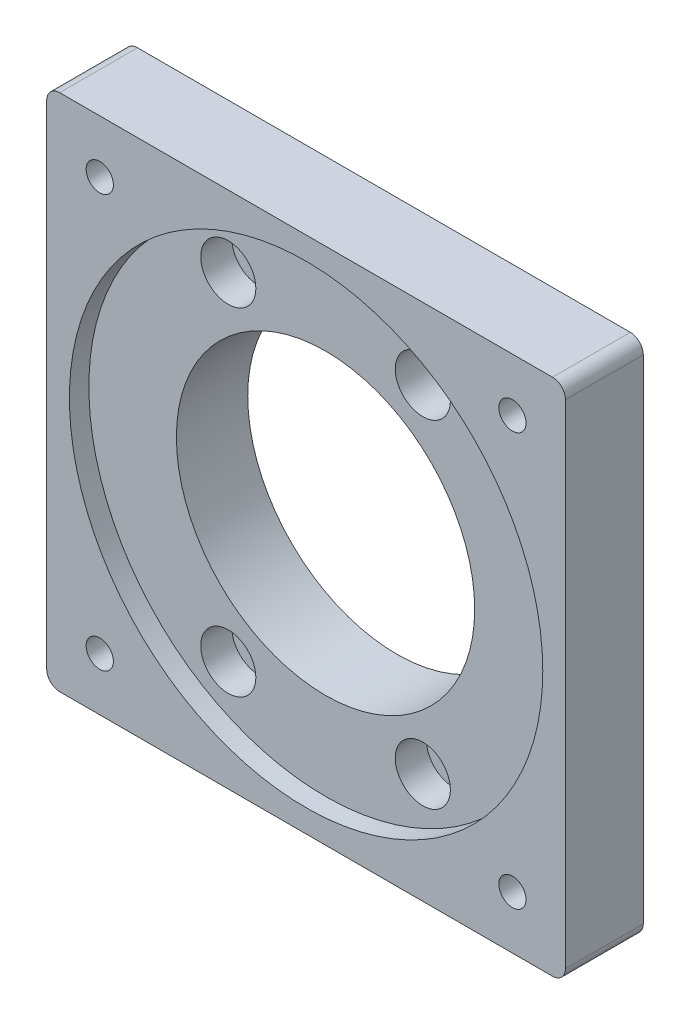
ISO-10303-21;
HEADER;
FILE_DESCRIPTION(('STEP AP214'),'2;1');
FILE_NAME('part.step','',(''),(''),'','','');
FILE_SCHEMA(('AUTOMOTIVE_DESIGN { 1 0 10303 214 1 1 1 1 }'));
ENDSEC;
DATA;
#1=APPLICATION_CONTEXT('core data for automotive mechanical design processes');
#2=APPLICATION_PROTOCOL_DEFINITION('international standard','automotive_design',2000,#1);
#3=PRODUCT_CONTEXT('',#1,'mechanical');
#4=PRODUCT('Part','Part','',(#3));
#5=PRODUCT_RELATED_PRODUCT_CATEGORY('part','',(#4));
#6=PRODUCT_DEFINITION_FORMATION('','',#4);
#7=PRODUCT_DEFINITION_CONTEXT('part definition',#1,'design');
#8=PRODUCT_DEFINITION('design','',#6,#7);
#9=PRODUCT_DEFINITION_SHAPE('','',#8);
#10=(LENGTH_UNIT() NAMED_UNIT(*) SI_UNIT(.MILLI.,.METRE.));
#11=(NAMED_UNIT(*) PLANE_ANGLE_UNIT() SI_UNIT($,.RADIAN.));
#12=(NAMED_UNIT(*) SI_UNIT($,.STERADIAN.) SOLID_ANGLE_UNIT());
#13=UNCERTAINTY_MEASURE_WITH_UNIT(LENGTH_MEASURE(1.E-05),#10,'distance_accuracy_value','');
#14=(GEOMETRIC_REPRESENTATION_CONTEXT(3) GLOBAL_UNCERTAINTY_ASSIGNED_CONTEXT((#13)) GLOBAL_UNIT_ASSIGNED_CONTEXT((#10,
#11,#12)) REPRESENTATION_CONTEXT('',''));
#15=CARTESIAN_POINT('',(0.,0.,0.));
#16=DIRECTION('',(0.,0.,1.));
#17=DIRECTION('',(1.,0.,0.));
#18=AXIS2_PLACEMENT_3D('',#15,#16,#17);
#19=CARTESIAN_POINT('',(0.,0.,0.));
#20=DIRECTION('',(0.,0.,-1.));
#21=DIRECTION('',(-1.,0.,0.));
#22=AXIS2_PLACEMENT_3D('',#19,#20,#21);
#23=PLANE('',#22);
#24=DIRECTION('',(0.,-1.,0.));
#25=VECTOR('',#24,1.);
#26=CARTESIAN_POINT('',(-40.,-40.,0.));
#27=LINE('',#26,#25);
#28=CARTESIAN_POINT('',(-40.,38.,0.));
#29=VERTEX_POINT('',#28);
#30=CARTESIAN_POINT('',(-40.,-38.,0.));
#31=VERTEX_POINT('',#30);
#32=EDGE_CURVE('E128',#29,#31,#27,.T.);
#33=ORIENTED_EDGE('',*,*,#32,.F.);
#34=CARTESIAN_POINT('',(-38.,38.,0.));
#35=DIRECTION('',(0.,0.,-1.));
#36=DIRECTION('',(-1.,0.,0.));
#37=AXIS2_PLACEMENT_3D('',#34,#35,#36);
#38=CIRCLE('',#37,2.);
#39=CARTESIAN_POINT('',(-38.,40.,0.));
#40=VERTEX_POINT('',#39);
#41=EDGE_CURVE('E110',#29,#40,#38,.T.);
#42=ORIENTED_EDGE('',*,*,#41,.T.);
#43=DIRECTION('',(-1.,0.,0.));
#44=VECTOR('',#43,1.);
#45=CARTESIAN_POINT('',(-40.,40.,0.));
#46=LINE('',#45,#44);
#47=CARTESIAN_POINT('',(38.,40.,0.));
#48=VERTEX_POINT('',#47);
#49=EDGE_CURVE('E139',#48,#40,#46,.T.);
#50=ORIENTED_EDGE('',*,*,#49,.F.);
#51=CARTESIAN_POINT('',(38.,38.,0.));
#52=DIRECTION('',(0.,0.,-1.));
#53=DIRECTION('',(-1.,0.,0.));
#54=AXIS2_PLACEMENT_3D('',#51,#52,#53);
#55=CIRCLE('',#54,2.);
#56=CARTESIAN_POINT('',(40.,38.,0.));
#57=VERTEX_POINT('',#56);
#58=EDGE_CURVE('E132',#48,#57,#55,.T.);
#59=ORIENTED_EDGE('',*,*,#58,.T.);
#60=DIRECTION('',(0.,1.,0.));
#61=VECTOR('',#60,1.);
#62=CARTESIAN_POINT('',(40.,-40.,0.));
#63=LINE('',#62,#61);
#64=CARTESIAN_POINT('',(40.,-38.,0.));
#65=VERTEX_POINT('',#64);
#66=EDGE_CURVE('E146',#65,#57,#63,.T.);
#67=ORIENTED_EDGE('',*,*,#66,.F.);
#68=CARTESIAN_POINT('',(38.,-38.,0.));
#69=DIRECTION('',(0.,0.,-1.));
#70=DIRECTION('',(-1.,0.,0.));
#71=AXIS2_PLACEMENT_3D('',#68,#69,#70);
#72=CIRCLE('',#71,2.);
#73=CARTESIAN_POINT('',(38.,-40.,0.));
#74=VERTEX_POINT('',#73);
#75=EDGE_CURVE('E185',#65,#74,#72,.T.);
#76=ORIENTED_EDGE('',*,*,#75,.T.);
#77=DIRECTION('',(1.,0.,0.));
#78=VECTOR('',#77,1.);
#79=CARTESIAN_POINT('',(-40.,-40.,0.));
#80=LINE('',#79,#78);
#81=CARTESIAN_POINT('',(-38.,-40.,0.));
#82=VERTEX_POINT('',#81);
#83=EDGE_CURVE('E138',#82,#74,#80,.T.);
#84=ORIENTED_EDGE('',*,*,#83,.F.);
#85=CARTESIAN_POINT('',(-38.,-38.,0.));
#86=DIRECTION('',(0.,0.,-1.));
#87=DIRECTION('',(-1.,0.,0.));
#88=AXIS2_PLACEMENT_3D('',#85,#86,#87);
#89=CIRCLE('',#88,2.);
#90=EDGE_CURVE('E122',#82,#31,#89,.T.);
#91=ORIENTED_EDGE('',*,*,#90,.T.);
#92=EDGE_LOOP('',(#33,#42,#50,#59,#67,#76,#84,#91));
#93=FACE_BOUND('',#92,.T.);
#94=CARTESIAN_POINT('',(-31.8198051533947,31.8198051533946,0.));
#95=DIRECTION('',(0.,0.,1.));
#96=DIRECTION('',(1.,0.,0.));
#97=AXIS2_PLACEMENT_3D('',#94,#95,#96);
#98=CIRCLE('',#97,2.1);
#99=CARTESIAN_POINT('',(-29.7198051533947,31.8198051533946,0.));
#100=VERTEX_POINT('',#99);
#101=EDGE_CURVE('E232',#100,#100,#98,.T.);
#102=ORIENTED_EDGE('',*,*,#101,.T.);
#103=EDGE_LOOP('',(#102));
#104=FACE_BOUND('',#103,.T.);
#105=CARTESIAN_POINT('',(31.8198051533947,31.8198051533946,0.));
#106=DIRECTION('',(0.,0.,1.));
#107=DIRECTION('',(1.,0.,0.));
#108=AXIS2_PLACEMENT_3D('',#105,#106,#107);
#109=CIRCLE('',#108,2.1);
#110=CARTESIAN_POINT('',(33.9198051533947,31.8198051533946,0.));
#111=VERTEX_POINT('',#110);
#112=EDGE_CURVE('E246',#111,#111,#109,.T.);
#113=ORIENTED_EDGE('',*,*,#112,.T.);
#114=EDGE_LOOP('',(#113));
#115=FACE_BOUND('',#114,.T.);
#116=CARTESIAN_POINT('',(31.8198051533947,-31.8198051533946,0.));
#117=DIRECTION('',(0.,0.,1.));
#118=DIRECTION('',(1.,0.,0.));
#119=AXIS2_PLACEMENT_3D('',#116,#117,#118);
#120=CIRCLE('',#119,2.1);
#121=CARTESIAN_POINT('',(33.9198051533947,-31.8198051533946,0.));
#122=VERTEX_POINT('',#121);
#123=EDGE_CURVE('E252',#122,#122,#120,.T.);
#124=ORIENTED_EDGE('',*,*,#123,.T.);
#125=EDGE_LOOP('',(#124));
#126=FACE_BOUND('',#125,.T.);
#127=CARTESIAN_POINT('',(-31.8198051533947,-31.8198051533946,0.));
#128=DIRECTION('',(0.,0.,1.));
#129=DIRECTION('',(1.,0.,0.));
#130=AXIS2_PLACEMENT_3D('',#127,#128,#129);
#131=CIRCLE('',#130,2.1);
#132=CARTESIAN_POINT('',(-29.7198051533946,-31.8198051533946,0.));
#133=VERTEX_POINT('',#132);
#134=EDGE_CURVE('E260',#133,#133,#131,.T.);
#135=ORIENTED_EDGE('',*,*,#134,.T.);
#136=EDGE_LOOP('',(#135));
#137=FACE_BOUND('',#136,.T.);
#138=CARTESIAN_POINT('',(-15.,25.9807621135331,0.));
#139=DIRECTION('',(0.,0.,1.));
#140=DIRECTION('',(1.,0.,0.));
#141=AXIS2_PLACEMENT_3D('',#138,#139,#140);
#142=CIRCLE('',#141,2.25);
#143=CARTESIAN_POINT('',(-12.75,25.9807621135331,0.));
#144=VERTEX_POINT('',#143);
#145=EDGE_CURVE('E274',#144,#144,#142,.T.);
#146=ORIENTED_EDGE('',*,*,#145,.T.);
#147=EDGE_LOOP('',(#146));
#148=FACE_BOUND('',#147,.T.);
#149=CARTESIAN_POINT('',(15.,25.9807621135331,0.));
#150=DIRECTION('',(0.,0.,1.));
#151=DIRECTION('',(1.,0.,0.));
#152=AXIS2_PLACEMENT_3D('',#149,#150,#151);
#153=CIRCLE('',#152,2.25);
#154=CARTESIAN_POINT('',(17.25,25.9807621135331,0.));
#155=VERTEX_POINT('',#154);
#156=EDGE_CURVE('E281',#155,#155,#153,.T.);
#157=ORIENTED_EDGE('',*,*,#156,.T.);
#158=EDGE_LOOP('',(#157));
#159=FACE_BOUND('',#158,.T.);
#160=CARTESIAN_POINT('',(15.,-25.9807621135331,0.));
#161=DIRECTION('',(0.,0.,1.));
#162=DIRECTION('',(1.,0.,0.));
#163=AXIS2_PLACEMENT_3D('',#160,#161,#162);
#164=CIRCLE('',#163,2.25);
#165=CARTESIAN_POINT('',(17.25,-25.9807621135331,0.));
#166=VERTEX_POINT('',#165);
#167=EDGE_CURVE('E285',#166,#166,#164,.T.);
#168=ORIENTED_EDGE('',*,*,#167,.T.);
#169=EDGE_LOOP('',(#168));
#170=FACE_BOUND('',#169,.T.);
#171=CARTESIAN_POINT('',(-15.,-25.9807621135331,0.));
#172=DIRECTION('',(0.,0.,1.));
#173=DIRECTION('',(1.,0.,0.));
#174=AXIS2_PLACEMENT_3D('',#171,#172,#173);
#175=CIRCLE('',#174,2.25);
#176=CARTESIAN_POINT('',(-12.75,-25.9807621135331,0.));
#177=VERTEX_POINT('',#176);
#178=EDGE_CURVE('E160',#177,#177,#175,.T.);
#179=ORIENTED_EDGE('',*,*,#178,.T.);
#180=EDGE_LOOP('',(#179));
#181=FACE_BOUND('',#180,.T.);
#182=CARTESIAN_POINT('',(0.,0.,0.));
#183=DIRECTION('',(0.,0.,-1.));
#184=DIRECTION('',(-1.,0.,0.));
#185=AXIS2_PLACEMENT_3D('',#182,#183,#184);
#186=CIRCLE('',#185,25.);
#187=CARTESIAN_POINT('',(-25.,0.,0.));
#188=VERTEX_POINT('',#187);
#189=EDGE_CURVE('E318',#188,#188,#186,.T.);
#190=ORIENTED_EDGE('',*,*,#189,.F.);
#191=EDGE_LOOP('',(#190));
#192=FACE_BOUND('',#191,.T.);
#193=ADVANCED_FACE('F42',(#93,#104,#115,#126,#137,#148,#159,#170,#181,#192),#23,.T.);
#194=CARTESIAN_POINT('',(-15.,-25.9807621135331,0.));
#195=DIRECTION('',(0.,0.,1.));
#196=DIRECTION('',(1.,0.,0.));
#197=AXIS2_PLACEMENT_3D('',#194,#195,#196);
#198=CYLINDRICAL_SURFACE('',#197,2.25);
#199=ORIENTED_EDGE('',*,*,#178,.F.);
#200=EDGE_LOOP('',(#199));
#201=FACE_BOUND('',#200,.T.);
#202=CARTESIAN_POINT('',(-15.,-25.9807621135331,4.2));
#203=DIRECTION('',(0.,0.,1.));
#204=DIRECTION('',(1.,0.,0.));
#205=AXIS2_PLACEMENT_3D('',#202,#203,#204);
#206=CIRCLE('',#205,2.25);
#207=CARTESIAN_POINT('',(-12.75,-25.9807621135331,4.2));
#208=VERTEX_POINT('',#207);
#209=EDGE_CURVE('E174',#208,#208,#206,.F.);
#210=ORIENTED_EDGE('',*,*,#209,.F.);
#211=EDGE_LOOP('',(#210));
#212=FACE_BOUND('',#211,.T.);
#213=ADVANCED_FACE('F345',(#201,#212),#198,.F.);
#214=CARTESIAN_POINT('',(15.,-25.9807621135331,0.));
#215=DIRECTION('',(0.,0.,1.));
#216=DIRECTION('',(1.,0.,0.));
#217=AXIS2_PLACEMENT_3D('',#214,#215,#216);
#218=CYLINDRICAL_SURFACE('',#217,2.25);
#219=ORIENTED_EDGE('',*,*,#167,.F.);
#220=EDGE_LOOP('',(#219));
#221=FACE_BOUND('',#220,.T.);
#222=CARTESIAN_POINT('',(15.,-25.9807621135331,4.2));
#223=DIRECTION('',(0.,0.,1.));
#224=DIRECTION('',(1.,0.,0.));
#225=AXIS2_PLACEMENT_3D('',#222,#223,#224);
#226=CIRCLE('',#225,2.25);
#227=CARTESIAN_POINT('',(17.25,-25.9807621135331,4.2));
#228=VERTEX_POINT('',#227);
#229=EDGE_CURVE('E168',#228,#228,#226,.F.);
#230=ORIENTED_EDGE('',*,*,#229,.F.);
#231=EDGE_LOOP('',(#230));
#232=FACE_BOUND('',#231,.T.);
#233=ADVANCED_FACE('F350',(#221,#232),#218,.F.);
#234=CARTESIAN_POINT('',(15.,25.9807621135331,0.));
#235=DIRECTION('',(0.,0.,1.));
#236=DIRECTION('',(1.,0.,0.));
#237=AXIS2_PLACEMENT_3D('',#234,#235,#236);
#238=CYLINDRICAL_SURFACE('',#237,2.25);
#239=ORIENTED_EDGE('',*,*,#156,.F.);
#240=EDGE_LOOP('',(#239));
#241=FACE_BOUND('',#240,.T.);
#242=CARTESIAN_POINT('',(15.,25.9807621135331,4.2));
#243=DIRECTION('',(0.,0.,1.));
#244=DIRECTION('',(1.,0.,0.));
#245=AXIS2_PLACEMENT_3D('',#242,#243,#244);
#246=CIRCLE('',#245,2.25);
#247=CARTESIAN_POINT('',(17.25,25.9807621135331,4.2));
#248=VERTEX_POINT('',#247);
#249=EDGE_CURVE('E162',#248,#248,#246,.F.);
#250=ORIENTED_EDGE('',*,*,#249,.F.);
#251=EDGE_LOOP('',(#250));
#252=FACE_BOUND('',#251,.T.);
#253=ADVANCED_FACE('F528',(#241,#252),#238,.F.);
#254=CARTESIAN_POINT('',(-15.,25.9807621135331,0.));
#255=DIRECTION('',(0.,0.,1.));
#256=DIRECTION('',(1.,0.,0.));
#257=AXIS2_PLACEMENT_3D('',#254,#255,#256);
#258=CYLINDRICAL_SURFACE('',#257,2.25);
#259=ORIENTED_EDGE('',*,*,#145,.F.);
#260=EDGE_LOOP('',(#259));
#261=FACE_BOUND('',#260,.T.);
#262=CARTESIAN_POINT('',(-15.,25.9807621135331,4.2));
#263=DIRECTION('',(0.,0.,1.));
#264=DIRECTION('',(1.,0.,0.));
#265=AXIS2_PLACEMENT_3D('',#262,#263,#264);
#266=CIRCLE('',#265,2.25);
#267=CARTESIAN_POINT('',(-12.75,25.9807621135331,4.2));
#268=VERTEX_POINT('',#267);
#269=EDGE_CURVE('E156',#268,#268,#266,.F.);
#270=ORIENTED_EDGE('',*,*,#269,.F.);
#271=EDGE_LOOP('',(#270));
#272=FACE_BOUND('',#271,.T.);
#273=ADVANCED_FACE('F404',(#261,#272),#258,.F.);
#274=CARTESIAN_POINT('',(0.,0.,12.));
#275=DIRECTION('',(0.,0.,-1.));
#276=DIRECTION('',(-1.,0.,0.));
#277=AXIS2_PLACEMENT_3D('',#274,#275,#276);
#278=CYLINDRICAL_SURFACE('',#277,23.);
#279=CARTESIAN_POINT('',(0.,0.,9.));
#280=DIRECTION('',(0.,0.,1.));
#281=DIRECTION('',(1.,0.,0.));
#282=AXIS2_PLACEMENT_3D('',#279,#280,#281);
#283=CIRCLE('',#282,23.);
#284=CARTESIAN_POINT('',(23.,0.,9.));
#285=VERTEX_POINT('',#284);
#286=EDGE_CURVE('E150',#285,#285,#283,.T.);
#287=ORIENTED_EDGE('',*,*,#286,.T.);
#288=EDGE_LOOP('',(#287));
#289=FACE_BOUND('',#288,.T.);
#290=CARTESIAN_POINT('',(0.,0.,-2.));
#291=DIRECTION('',(0.,0.,-1.));
#292=DIRECTION('',(-1.,0.,0.));
#293=AXIS2_PLACEMENT_3D('',#290,#291,#292);
#294=CIRCLE('',#293,23.);
#295=CARTESIAN_POINT('',(-23.,0.,-2.));
#296=VERTEX_POINT('',#295);
#297=EDGE_CURVE('E322',#296,#296,#294,.T.);
#298=ORIENTED_EDGE('',*,*,#297,.T.);
#299=EDGE_LOOP('',(#298));
#300=FACE_BOUND('',#299,.T.);
#301=ADVANCED_FACE('F330',(#289,#300),#278,.F.);
#302=CARTESIAN_POINT('',(0.,0.,12.));
#303=DIRECTION('',(0.,0.,-1.));
#304=DIRECTION('',(-1.,0.,0.));
#305=AXIS2_PLACEMENT_3D('',#302,#303,#304);
#306=PLANE('',#305);
#307=CARTESIAN_POINT('',(0.,0.,12.));
#308=DIRECTION('',(0.,0.,1.));
#309=DIRECTION('',(1.,0.,0.));
#310=AXIS2_PLACEMENT_3D('',#307,#308,#309);
#311=CIRCLE('',#310,36.5);
#312=CARTESIAN_POINT('',(36.5,0.,12.));
#313=VERTEX_POINT('',#312);
#314=EDGE_CURVE('E270',#313,#313,#311,.T.);
#315=ORIENTED_EDGE('',*,*,#314,.F.);
#316=EDGE_LOOP('',(#315));
#317=FACE_BOUND('',#316,.T.);
#318=CARTESIAN_POINT('',(-31.8198051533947,-31.8198051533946,12.));
#319=DIRECTION('',(0.,0.,1.));
#320=DIRECTION('',(1.,0.,0.));
#321=AXIS2_PLACEMENT_3D('',#318,#319,#320);
#322=CIRCLE('',#321,2.1);
#323=CARTESIAN_POINT('',(-29.7198051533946,-31.8198051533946,12.));
#324=VERTEX_POINT('',#323);
#325=EDGE_CURVE('E154',#324,#324,#322,.T.);
#326=ORIENTED_EDGE('',*,*,#325,.F.);
#327=EDGE_LOOP('',(#326));
#328=FACE_BOUND('',#327,.T.);
#329=CARTESIAN_POINT('',(31.8198051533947,-31.8198051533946,12.));
#330=DIRECTION('',(0.,0.,1.));
#331=DIRECTION('',(1.,0.,0.));
#332=AXIS2_PLACEMENT_3D('',#329,#330,#331);
#333=CIRCLE('',#332,2.1);
#334=CARTESIAN_POINT('',(33.9198051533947,-31.8198051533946,12.));
#335=VERTEX_POINT('',#334);
#336=EDGE_CURVE('E256',#335,#335,#333,.T.);
#337=ORIENTED_EDGE('',*,*,#336,.F.);
#338=EDGE_LOOP('',(#337));
#339=FACE_BOUND('',#338,.T.);
#340=CARTESIAN_POINT('',(31.8198051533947,31.8198051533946,12.));
#341=DIRECTION('',(0.,0.,1.));
#342=DIRECTION('',(1.,0.,0.));
#343=AXIS2_PLACEMENT_3D('',#340,#341,#342);
#344=CIRCLE('',#343,2.1);
#345=CARTESIAN_POINT('',(33.9198051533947,31.8198051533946,12.));
#346=VERTEX_POINT('',#345);
#347=EDGE_CURVE('E248',#346,#346,#344,.T.);
#348=ORIENTED_EDGE('',*,*,#347,.F.);
#349=EDGE_LOOP('',(#348));
#350=FACE_BOUND('',#349,.T.);
#351=CARTESIAN_POINT('',(-31.8198051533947,31.8198051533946,12.));
#352=DIRECTION('',(0.,0.,1.));
#353=DIRECTION('',(1.,0.,0.));
#354=AXIS2_PLACEMENT_3D('',#351,#352,#353);
#355=CIRCLE('',#354,2.1);
#356=CARTESIAN_POINT('',(-29.7198051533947,31.8198051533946,12.));
#357=VERTEX_POINT('',#356);
#358=EDGE_CURVE('E235',#357,#357,#355,.T.);
#359=ORIENTED_EDGE('',*,*,#358,.F.);
#360=EDGE_LOOP('',(#359));
#361=FACE_BOUND('',#360,.T.);
#362=DIRECTION('',(-1.,0.,0.));
#363=VECTOR('',#362,1.);
#364=CARTESIAN_POINT('',(-40.,40.,12.));
#365=LINE('',#364,#363);
#366=CARTESIAN_POINT('',(38.,40.,12.));
#367=VERTEX_POINT('',#366);
#368=CARTESIAN_POINT('',(-38.,40.,12.));
#369=VERTEX_POINT('',#368);
#370=EDGE_CURVE('E226',#367,#369,#365,.T.);
#371=ORIENTED_EDGE('',*,*,#370,.T.);
#372=CARTESIAN_POINT('',(-38.,38.,12.));
#373=DIRECTION('',(0.,0.,-1.));
#374=DIRECTION('',(-1.,0.,0.));
#375=AXIS2_PLACEMENT_3D('',#372,#373,#374);
#376=CIRCLE('',#375,2.);
#377=CARTESIAN_POINT('',(-40.,38.,12.));
#378=VERTEX_POINT('',#377);
#379=EDGE_CURVE('E203',#369,#378,#376,.F.);
#380=ORIENTED_EDGE('',*,*,#379,.T.);
#381=DIRECTION('',(0.,-1.,0.));
#382=VECTOR('',#381,1.);
#383=CARTESIAN_POINT('',(-40.,-40.,12.));
#384=LINE('',#383,#382);
#385=CARTESIAN_POINT('',(-40.,-38.,12.));
#386=VERTEX_POINT('',#385);
#387=EDGE_CURVE('E130',#378,#386,#384,.T.);
#388=ORIENTED_EDGE('',*,*,#387,.T.);
#389=CARTESIAN_POINT('',(-38.,-38.,12.));
#390=DIRECTION('',(0.,0.,-1.));
#391=DIRECTION('',(-1.,0.,0.));
#392=AXIS2_PLACEMENT_3D('',#389,#390,#391);
#393=CIRCLE('',#392,2.);
#394=CARTESIAN_POINT('',(-38.,-40.,12.));
#395=VERTEX_POINT('',#394);
#396=EDGE_CURVE('E65',#386,#395,#393,.F.);
#397=ORIENTED_EDGE('',*,*,#396,.T.);
#398=DIRECTION('',(1.,0.,0.));
#399=VECTOR('',#398,1.);
#400=CARTESIAN_POINT('',(-40.,-40.,12.));
#401=LINE('',#400,#399);
#402=CARTESIAN_POINT('',(38.,-40.,12.));
#403=VERTEX_POINT('',#402);
#404=EDGE_CURVE('E181',#395,#403,#401,.T.);
#405=ORIENTED_EDGE('',*,*,#404,.T.);
#406=CARTESIAN_POINT('',(38.,-38.,12.));
#407=DIRECTION('',(0.,0.,-1.));
#408=DIRECTION('',(-1.,0.,0.));
#409=AXIS2_PLACEMENT_3D('',#406,#407,#408);
#410=CIRCLE('',#409,2.);
#411=CARTESIAN_POINT('',(40.,-38.,12.));
#412=VERTEX_POINT('',#411);
#413=EDGE_CURVE('E198',#403,#412,#410,.F.);
#414=ORIENTED_EDGE('',*,*,#413,.T.);
#415=DIRECTION('',(0.,1.,0.));
#416=VECTOR('',#415,1.);
#417=CARTESIAN_POINT('',(40.,-40.,12.));
#418=LINE('',#417,#416);
#419=CARTESIAN_POINT('',(40.,38.,12.));
#420=VERTEX_POINT('',#419);
#421=EDGE_CURVE('E143',#412,#420,#418,.T.);
#422=ORIENTED_EDGE('',*,*,#421,.T.);
#423=CARTESIAN_POINT('',(38.,38.,12.));
#424=DIRECTION('',(0.,0.,-1.));
#425=DIRECTION('',(-1.,0.,0.));
#426=AXIS2_PLACEMENT_3D('',#423,#424,#425);
#427=CIRCLE('',#426,2.);
#428=EDGE_CURVE('E195',#420,#367,#427,.F.);
#429=ORIENTED_EDGE('',*,*,#428,.T.);
#430=EDGE_LOOP('',(#371,#380,#388,#397,#405,#414,#422,#429));
#431=FACE_BOUND('',#430,.T.);
#432=ADVANCED_FACE('F222',(#317,#328,#339,#350,#361,#431),#306,.F.);
#433=CARTESIAN_POINT('',(40.,-40.,12.));
#434=DIRECTION('',(-1.,0.,0.));
#435=DIRECTION('',(0.,0.,1.));
#436=AXIS2_PLACEMENT_3D('',#433,#434,#435);
#437=PLANE('',#436);
#438=ORIENTED_EDGE('',*,*,#421,.F.);
#439=DIRECTION('',(0.,0.,-1.));
#440=VECTOR('',#439,1.);
#441=CARTESIAN_POINT('',(40.,-38.,12.));
#442=LINE('',#441,#440);
#443=EDGE_CURVE('E11',#412,#65,#442,.T.);
#444=ORIENTED_EDGE('',*,*,#443,.T.);
#445=ORIENTED_EDGE('',*,*,#66,.T.);
#446=DIRECTION('',(0.,0.,-1.));
#447=VECTOR('',#446,1.);
#448=CARTESIAN_POINT('',(40.,38.,12.));
#449=LINE('',#448,#447);
#450=EDGE_CURVE('E51',#57,#420,#449,.F.);
#451=ORIENTED_EDGE('',*,*,#450,.T.);
#452=EDGE_LOOP('',(#438,#444,#445,#451));
#453=FACE_BOUND('',#452,.T.);
#454=ADVANCED_FACE('F216',(#453),#437,.F.);
#455=CARTESIAN_POINT('',(-40.,40.,12.));
#456=DIRECTION('',(0.,-1.,0.));
#457=DIRECTION('',(0.,0.,-1.));
#458=AXIS2_PLACEMENT_3D('',#455,#456,#457);
#459=PLANE('',#458);
#460=ORIENTED_EDGE('',*,*,#49,.T.);
#461=DIRECTION('',(0.,0.,-1.));
#462=VECTOR('',#461,1.);
#463=CARTESIAN_POINT('',(-38.,40.,12.));
#464=LINE('',#463,#462);
#465=EDGE_CURVE('E115',#40,#369,#464,.F.);
#466=ORIENTED_EDGE('',*,*,#465,.T.);
#467=ORIENTED_EDGE('',*,*,#370,.F.);
#468=DIRECTION('',(0.,0.,-1.));
#469=VECTOR('',#468,1.);
#470=CARTESIAN_POINT('',(38.,40.,12.));
#471=LINE('',#470,#469);
#472=EDGE_CURVE('E121',#367,#48,#471,.T.);
#473=ORIENTED_EDGE('',*,*,#472,.T.);
#474=EDGE_LOOP('',(#460,#466,#467,#473));
#475=FACE_BOUND('',#474,.T.);
#476=ADVANCED_FACE('F230',(#475),#459,.F.);
#477=CARTESIAN_POINT('',(-40.,-40.,12.));
#478=DIRECTION('',(1.,0.,0.));
#479=DIRECTION('',(0.,0.,-1.));
#480=AXIS2_PLACEMENT_3D('',#477,#478,#479);
#481=PLANE('',#480);
#482=ORIENTED_EDGE('',*,*,#387,.F.);
#483=DIRECTION('',(0.,0.,-1.));
#484=VECTOR('',#483,1.);
#485=CARTESIAN_POINT('',(-40.,38.,12.));
#486=LINE('',#485,#484);
#487=EDGE_CURVE('E114',#378,#29,#486,.T.);
#488=ORIENTED_EDGE('',*,*,#487,.T.);
#489=ORIENTED_EDGE('',*,*,#32,.T.);
#490=DIRECTION('',(0.,0.,-1.));
#491=VECTOR('',#490,1.);
#492=CARTESIAN_POINT('',(-40.,-38.,12.));
#493=LINE('',#492,#491);
#494=EDGE_CURVE('E133',#31,#386,#493,.F.);
#495=ORIENTED_EDGE('',*,*,#494,.T.);
#496=EDGE_LOOP('',(#482,#488,#489,#495));
#497=FACE_BOUND('',#496,.T.);
#498=ADVANCED_FACE('F127',(#497),#481,.F.);
#499=CARTESIAN_POINT('',(-40.,-40.,12.));
#500=DIRECTION('',(0.,1.,0.));
#501=DIRECTION('',(0.,0.,1.));
#502=AXIS2_PLACEMENT_3D('',#499,#500,#501);
#503=PLANE('',#502);
#504=ORIENTED_EDGE('',*,*,#404,.F.);
#505=DIRECTION('',(0.,0.,-1.));
#506=VECTOR('',#505,1.);
#507=CARTESIAN_POINT('',(-38.,-40.,12.));
#508=LINE('',#507,#506);
#509=EDGE_CURVE('E208',#395,#82,#508,.T.);
#510=ORIENTED_EDGE('',*,*,#509,.T.);
#511=ORIENTED_EDGE('',*,*,#83,.T.);
#512=DIRECTION('',(0.,0.,-1.));
#513=VECTOR('',#512,1.);
#514=CARTESIAN_POINT('',(38.,-40.,12.));
#515=LINE('',#514,#513);
#516=EDGE_CURVE('E58',#74,#403,#515,.F.);
#517=ORIENTED_EDGE('',*,*,#516,.T.);
#518=EDGE_LOOP('',(#504,#510,#511,#517));
#519=FACE_BOUND('',#518,.T.);
#520=ADVANCED_FACE('F356',(#519),#503,.F.);
#521=CARTESIAN_POINT('',(-31.8198051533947,31.8198051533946,0.));
#522=DIRECTION('',(0.,0.,1.));
#523=DIRECTION('',(1.,0.,0.));
#524=AXIS2_PLACEMENT_3D('',#521,#522,#523);
#525=CYLINDRICAL_SURFACE('',#524,2.1);
#526=ORIENTED_EDGE('',*,*,#101,.F.);
#527=EDGE_LOOP('',(#526));
#528=FACE_BOUND('',#527,.T.);
#529=ORIENTED_EDGE('',*,*,#358,.T.);
#530=EDGE_LOOP('',(#529));
#531=FACE_BOUND('',#530,.T.);
#532=ADVANCED_FACE('F359',(#528,#531),#525,.F.);
#533=CARTESIAN_POINT('',(31.8198051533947,31.8198051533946,0.));
#534=DIRECTION('',(0.,0.,1.));
#535=DIRECTION('',(1.,0.,0.));
#536=AXIS2_PLACEMENT_3D('',#533,#534,#535);
#537=CYLINDRICAL_SURFACE('',#536,2.1);
#538=ORIENTED_EDGE('',*,*,#112,.F.);
#539=EDGE_LOOP('',(#538));
#540=FACE_BOUND('',#539,.T.);
#541=ORIENTED_EDGE('',*,*,#347,.T.);
#542=EDGE_LOOP('',(#541));
#543=FACE_BOUND('',#542,.T.);
#544=ADVANCED_FACE('F585',(#540,#543),#537,.F.);
#545=CARTESIAN_POINT('',(31.8198051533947,-31.8198051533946,0.));
#546=DIRECTION('',(0.,0.,1.));
#547=DIRECTION('',(1.,0.,0.));
#548=AXIS2_PLACEMENT_3D('',#545,#546,#547);
#549=CYLINDRICAL_SURFACE('',#548,2.1);
#550=ORIENTED_EDGE('',*,*,#123,.F.);
#551=EDGE_LOOP('',(#550));
#552=FACE_BOUND('',#551,.T.);
#553=ORIENTED_EDGE('',*,*,#336,.T.);
#554=EDGE_LOOP('',(#553));
#555=FACE_BOUND('',#554,.T.);
#556=ADVANCED_FACE('F573',(#552,#555),#549,.F.);
#557=CARTESIAN_POINT('',(-31.8198051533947,-31.8198051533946,0.));
#558=DIRECTION('',(0.,0.,1.));
#559=DIRECTION('',(1.,0.,0.));
#560=AXIS2_PLACEMENT_3D('',#557,#558,#559);
#561=CYLINDRICAL_SURFACE('',#560,2.1);
#562=ORIENTED_EDGE('',*,*,#134,.F.);
#563=EDGE_LOOP('',(#562));
#564=FACE_BOUND('',#563,.T.);
#565=ORIENTED_EDGE('',*,*,#325,.T.);
#566=EDGE_LOOP('',(#565));
#567=FACE_BOUND('',#566,.T.);
#568=ADVANCED_FACE('F562',(#564,#567),#561,.F.);
#569=CARTESIAN_POINT('',(0.,0.,9.));
#570=DIRECTION('',(0.,0.,1.));
#571=DIRECTION('',(1.,0.,0.));
#572=AXIS2_PLACEMENT_3D('',#569,#570,#571);
#573=CYLINDRICAL_SURFACE('',#572,36.5);
#574=CARTESIAN_POINT('',(0.,0.,9.));
#575=DIRECTION('',(0.,0.,1.));
#576=DIRECTION('',(1.,0.,0.));
#577=AXIS2_PLACEMENT_3D('',#574,#575,#576);
#578=CIRCLE('',#577,36.5);
#579=CARTESIAN_POINT('',(36.5,0.,9.));
#580=VERTEX_POINT('',#579);
#581=EDGE_CURVE('E155',#580,#580,#578,.T.);
#582=ORIENTED_EDGE('',*,*,#581,.F.);
#583=EDGE_LOOP('',(#582));
#584=FACE_BOUND('',#583,.T.);
#585=ORIENTED_EDGE('',*,*,#314,.T.);
#586=EDGE_LOOP('',(#585));
#587=FACE_BOUND('',#586,.T.);
#588=ADVANCED_FACE('F554',(#584,#587),#573,.F.);
#589=CARTESIAN_POINT('',(0.,0.,9.));
#590=DIRECTION('',(0.,0.,1.));
#591=DIRECTION('',(1.,0.,0.));
#592=AXIS2_PLACEMENT_3D('',#589,#590,#591);
#593=PLANE('',#592);
#594=CARTESIAN_POINT('',(-15.,-25.9807621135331,9.));
#595=DIRECTION('',(0.,0.,1.));
#596=DIRECTION('',(1.,0.,0.));
#597=AXIS2_PLACEMENT_3D('',#594,#595,#596);
#598=CIRCLE('',#597,4.25);
#599=CARTESIAN_POINT('',(-10.75,-25.9807621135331,9.));
#600=VERTEX_POINT('',#599);
#601=EDGE_CURVE('E310',#600,#600,#598,.T.);
#602=ORIENTED_EDGE('',*,*,#601,.F.);
#603=EDGE_LOOP('',(#602));
#604=FACE_BOUND('',#603,.T.);
#605=CARTESIAN_POINT('',(15.,-25.9807621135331,9.));
#606=DIRECTION('',(0.,0.,1.));
#607=DIRECTION('',(1.,0.,0.));
#608=AXIS2_PLACEMENT_3D('',#605,#606,#607);
#609=CIRCLE('',#608,4.25);
#610=CARTESIAN_POINT('',(19.25,-25.9807621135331,9.));
#611=VERTEX_POINT('',#610);
#612=EDGE_CURVE('E178',#611,#611,#609,.T.);
#613=ORIENTED_EDGE('',*,*,#612,.F.);
#614=EDGE_LOOP('',(#613));
#615=FACE_BOUND('',#614,.T.);
#616=CARTESIAN_POINT('',(15.,25.9807621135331,9.));
#617=DIRECTION('',(0.,0.,1.));
#618=DIRECTION('',(1.,0.,0.));
#619=AXIS2_PLACEMENT_3D('',#616,#617,#618);
#620=CIRCLE('',#619,4.25);
#621=CARTESIAN_POINT('',(19.25,25.9807621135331,9.));
#622=VERTEX_POINT('',#621);
#623=EDGE_CURVE('E172',#622,#622,#620,.T.);
#624=ORIENTED_EDGE('',*,*,#623,.F.);
#625=EDGE_LOOP('',(#624));
#626=FACE_BOUND('',#625,.T.);
#627=CARTESIAN_POINT('',(-15.,25.9807621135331,9.));
#628=DIRECTION('',(0.,0.,1.));
#629=DIRECTION('',(1.,0.,0.));
#630=AXIS2_PLACEMENT_3D('',#627,#628,#629);
#631=CIRCLE('',#630,4.25);
#632=CARTESIAN_POINT('',(-10.75,25.9807621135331,9.));
#633=VERTEX_POINT('',#632);
#634=EDGE_CURVE('E166',#633,#633,#631,.T.);
#635=ORIENTED_EDGE('',*,*,#634,.F.);
#636=EDGE_LOOP('',(#635));
#637=FACE_BOUND('',#636,.T.);
#638=ORIENTED_EDGE('',*,*,#286,.F.);
#639=EDGE_LOOP('',(#638));
#640=FACE_BOUND('',#639,.T.);
#641=ORIENTED_EDGE('',*,*,#581,.T.);
#642=EDGE_LOOP('',(#641));
#643=FACE_BOUND('',#642,.T.);
#644=ADVANCED_FACE('F510',(#604,#615,#626,#637,#640,#643),#593,.T.);
#645=CARTESIAN_POINT('',(-15.,25.9807621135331,4.2));
#646=DIRECTION('',(0.,0.,1.));
#647=DIRECTION('',(1.,0.,0.));
#648=AXIS2_PLACEMENT_3D('',#645,#646,#647);
#649=PLANE('',#648);
#650=CARTESIAN_POINT('',(-15.,25.9807621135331,4.2));
#651=DIRECTION('',(0.,0.,1.));
#652=DIRECTION('',(1.,0.,0.));
#653=AXIS2_PLACEMENT_3D('',#650,#651,#652);
#654=CIRCLE('',#653,4.25);
#655=CARTESIAN_POINT('',(-10.75,25.9807621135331,4.2));
#656=VERTEX_POINT('',#655);
#657=EDGE_CURVE('E161',#656,#656,#654,.T.);
#658=ORIENTED_EDGE('',*,*,#657,.T.);
#659=EDGE_LOOP('',(#658));
#660=FACE_BOUND('',#659,.T.);
#661=ORIENTED_EDGE('',*,*,#269,.T.);
#662=EDGE_LOOP('',(#661));
#663=FACE_BOUND('',#662,.T.);
#664=ADVANCED_FACE('F500',(#660,#663),#649,.T.);
#665=CARTESIAN_POINT('',(-15.,25.9807621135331,4.2));
#666=DIRECTION('',(0.,0.,1.));
#667=DIRECTION('',(1.,0.,0.));
#668=AXIS2_PLACEMENT_3D('',#665,#666,#667);
#669=CYLINDRICAL_SURFACE('',#668,4.25);
#670=ORIENTED_EDGE('',*,*,#657,.F.);
#671=EDGE_LOOP('',(#670));
#672=FACE_BOUND('',#671,.T.);
#673=ORIENTED_EDGE('',*,*,#634,.T.);
#674=EDGE_LOOP('',(#673));
#675=FACE_BOUND('',#674,.T.);
#676=ADVANCED_FACE('F490',(#672,#675),#669,.F.);
#677=CARTESIAN_POINT('',(15.,25.9807621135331,4.2));
#678=DIRECTION('',(0.,0.,1.));
#679=DIRECTION('',(1.,0.,0.));
#680=AXIS2_PLACEMENT_3D('',#677,#678,#679);
#681=PLANE('',#680);
#682=CARTESIAN_POINT('',(15.,25.9807621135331,4.2));
#683=DIRECTION('',(0.,0.,1.));
#684=DIRECTION('',(1.,0.,0.));
#685=AXIS2_PLACEMENT_3D('',#682,#683,#684);
#686=CIRCLE('',#685,4.25);
#687=CARTESIAN_POINT('',(19.25,25.9807621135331,4.2));
#688=VERTEX_POINT('',#687);
#689=EDGE_CURVE('E167',#688,#688,#686,.T.);
#690=ORIENTED_EDGE('',*,*,#689,.T.);
#691=EDGE_LOOP('',(#690));
#692=FACE_BOUND('',#691,.T.);
#693=ORIENTED_EDGE('',*,*,#249,.T.);
#694=EDGE_LOOP('',(#693));
#695=FACE_BOUND('',#694,.T.);
#696=ADVANCED_FACE('F480',(#692,#695),#681,.T.);
#697=CARTESIAN_POINT('',(15.,25.9807621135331,4.2));
#698=DIRECTION('',(0.,0.,1.));
#699=DIRECTION('',(1.,0.,0.));
#700=AXIS2_PLACEMENT_3D('',#697,#698,#699);
#701=CYLINDRICAL_SURFACE('',#700,4.25);
#702=ORIENTED_EDGE('',*,*,#689,.F.);
#703=EDGE_LOOP('',(#702));
#704=FACE_BOUND('',#703,.T.);
#705=ORIENTED_EDGE('',*,*,#623,.T.);
#706=EDGE_LOOP('',(#705));
#707=FACE_BOUND('',#706,.T.);
#708=ADVANCED_FACE('F470',(#704,#707),#701,.F.);
#709=CARTESIAN_POINT('',(15.,-25.9807621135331,4.2));
#710=DIRECTION('',(0.,0.,1.));
#711=DIRECTION('',(1.,0.,0.));
#712=AXIS2_PLACEMENT_3D('',#709,#710,#711);
#713=PLANE('',#712);
#714=CARTESIAN_POINT('',(15.,-25.9807621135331,4.2));
#715=DIRECTION('',(0.,0.,1.));
#716=DIRECTION('',(1.,0.,0.));
#717=AXIS2_PLACEMENT_3D('',#714,#715,#716);
#718=CIRCLE('',#717,4.25);
#719=CARTESIAN_POINT('',(19.25,-25.9807621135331,4.2));
#720=VERTEX_POINT('',#719);
#721=EDGE_CURVE('E173',#720,#720,#718,.T.);
#722=ORIENTED_EDGE('',*,*,#721,.T.);
#723=EDGE_LOOP('',(#722));
#724=FACE_BOUND('',#723,.T.);
#725=ORIENTED_EDGE('',*,*,#229,.T.);
#726=EDGE_LOOP('',(#725));
#727=FACE_BOUND('',#726,.T.);
#728=ADVANCED_FACE('F460',(#724,#727),#713,.T.);
#729=CARTESIAN_POINT('',(15.,-25.9807621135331,4.2));
#730=DIRECTION('',(0.,0.,1.));
#731=DIRECTION('',(1.,0.,0.));
#732=AXIS2_PLACEMENT_3D('',#729,#730,#731);
#733=CYLINDRICAL_SURFACE('',#732,4.25);
#734=ORIENTED_EDGE('',*,*,#721,.F.);
#735=EDGE_LOOP('',(#734));
#736=FACE_BOUND('',#735,.T.);
#737=ORIENTED_EDGE('',*,*,#612,.T.);
#738=EDGE_LOOP('',(#737));
#739=FACE_BOUND('',#738,.T.);
#740=ADVANCED_FACE('F450',(#736,#739),#733,.F.);
#741=CARTESIAN_POINT('',(-15.,-25.9807621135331,4.2));
#742=DIRECTION('',(0.,0.,1.));
#743=DIRECTION('',(1.,0.,0.));
#744=AXIS2_PLACEMENT_3D('',#741,#742,#743);
#745=PLANE('',#744);
#746=CARTESIAN_POINT('',(-15.,-25.9807621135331,4.2));
#747=DIRECTION('',(0.,0.,1.));
#748=DIRECTION('',(1.,0.,0.));
#749=AXIS2_PLACEMENT_3D('',#746,#747,#748);
#750=CIRCLE('',#749,4.25);
#751=CARTESIAN_POINT('',(-10.75,-25.9807621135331,4.2));
#752=VERTEX_POINT('',#751);
#753=EDGE_CURVE('E179',#752,#752,#750,.T.);
#754=ORIENTED_EDGE('',*,*,#753,.T.);
#755=EDGE_LOOP('',(#754));
#756=FACE_BOUND('',#755,.T.);
#757=ORIENTED_EDGE('',*,*,#209,.T.);
#758=EDGE_LOOP('',(#757));
#759=FACE_BOUND('',#758,.T.);
#760=ADVANCED_FACE('F439',(#756,#759),#745,.T.);
#761=CARTESIAN_POINT('',(-15.,-25.9807621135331,4.2));
#762=DIRECTION('',(0.,0.,1.));
#763=DIRECTION('',(1.,0.,0.));
#764=AXIS2_PLACEMENT_3D('',#761,#762,#763);
#765=CYLINDRICAL_SURFACE('',#764,4.25);
#766=ORIENTED_EDGE('',*,*,#753,.F.);
#767=EDGE_LOOP('',(#766));
#768=FACE_BOUND('',#767,.T.);
#769=ORIENTED_EDGE('',*,*,#601,.T.);
#770=EDGE_LOOP('',(#769));
#771=FACE_BOUND('',#770,.T.);
#772=ADVANCED_FACE('F369',(#768,#771),#765,.F.);
#773=CARTESIAN_POINT('',(-38.,38.,12.));
#774=DIRECTION('',(0.,0.,-1.));
#775=DIRECTION('',(-1.,0.,0.));
#776=AXIS2_PLACEMENT_3D('',#773,#774,#775);
#777=CYLINDRICAL_SURFACE('',#776,2.);
#778=ORIENTED_EDGE('',*,*,#379,.F.);
#779=ORIENTED_EDGE('',*,*,#465,.F.);
#780=ORIENTED_EDGE('',*,*,#41,.F.);
#781=ORIENTED_EDGE('',*,*,#487,.F.);
#782=EDGE_LOOP('',(#778,#779,#780,#781));
#783=FACE_BOUND('',#782,.T.);
#784=ADVANCED_FACE('F113',(#783),#777,.T.);
#785=CARTESIAN_POINT('',(-38.,-38.,12.));
#786=DIRECTION('',(0.,0.,-1.));
#787=DIRECTION('',(-1.,0.,0.));
#788=AXIS2_PLACEMENT_3D('',#785,#786,#787);
#789=CYLINDRICAL_SURFACE('',#788,2.);
#790=ORIENTED_EDGE('',*,*,#396,.F.);
#791=ORIENTED_EDGE('',*,*,#494,.F.);
#792=ORIENTED_EDGE('',*,*,#90,.F.);
#793=ORIENTED_EDGE('',*,*,#509,.F.);
#794=EDGE_LOOP('',(#790,#791,#792,#793));
#795=FACE_BOUND('',#794,.T.);
#796=ADVANCED_FACE('F368',(#795),#789,.T.);
#797=CARTESIAN_POINT('',(38.,-38.,12.));
#798=DIRECTION('',(0.,0.,-1.));
#799=DIRECTION('',(-1.,0.,0.));
#800=AXIS2_PLACEMENT_3D('',#797,#798,#799);
#801=CYLINDRICAL_SURFACE('',#800,2.);
#802=ORIENTED_EDGE('',*,*,#413,.F.);
#803=ORIENTED_EDGE('',*,*,#516,.F.);
#804=ORIENTED_EDGE('',*,*,#75,.F.);
#805=ORIENTED_EDGE('',*,*,#443,.F.);
#806=EDGE_LOOP('',(#802,#803,#804,#805));
#807=FACE_BOUND('',#806,.T.);
#808=ADVANCED_FACE('F343',(#807),#801,.T.);
#809=CARTESIAN_POINT('',(38.,38.,12.));
#810=DIRECTION('',(0.,0.,-1.));
#811=DIRECTION('',(-1.,0.,0.));
#812=AXIS2_PLACEMENT_3D('',#809,#810,#811);
#813=CYLINDRICAL_SURFACE('',#812,2.);
#814=ORIENTED_EDGE('',*,*,#428,.F.);
#815=ORIENTED_EDGE('',*,*,#450,.F.);
#816=ORIENTED_EDGE('',*,*,#58,.F.);
#817=ORIENTED_EDGE('',*,*,#472,.F.);
#818=EDGE_LOOP('',(#814,#815,#816,#817));
#819=FACE_BOUND('',#818,.T.);
#820=ADVANCED_FACE('F44',(#819),#813,.T.);
#821=CARTESIAN_POINT('',(0.,0.,-2.));
#822=DIRECTION('',(0.,0.,-1.));
#823=DIRECTION('',(-1.,0.,0.));
#824=AXIS2_PLACEMENT_3D('',#821,#822,#823);
#825=PLANE('',#824);
#826=CARTESIAN_POINT('',(0.,0.,-2.));
#827=DIRECTION('',(0.,0.,-1.));
#828=DIRECTION('',(-1.,0.,0.));
#829=AXIS2_PLACEMENT_3D('',#826,#827,#828);
#830=CIRCLE('',#829,25.);
#831=CARTESIAN_POINT('',(-25.,0.,-2.));
#832=VERTEX_POINT('',#831);
#833=EDGE_CURVE('E314',#832,#832,#830,.T.);
#834=ORIENTED_EDGE('',*,*,#833,.T.);
#835=EDGE_LOOP('',(#834));
#836=FACE_BOUND('',#835,.T.);
#837=ORIENTED_EDGE('',*,*,#297,.F.);
#838=EDGE_LOOP('',(#837));
#839=FACE_BOUND('',#838,.T.);
#840=ADVANCED_FACE('F332',(#836,#839),#825,.T.);
#841=CARTESIAN_POINT('',(0.,0.,-2.));
#842=DIRECTION('',(0.,0.,1.));
#843=DIRECTION('',(1.,0.,0.));
#844=AXIS2_PLACEMENT_3D('',#841,#842,#843);
#845=CYLINDRICAL_SURFACE('',#844,25.);
#846=ORIENTED_EDGE('',*,*,#833,.F.);
#847=EDGE_LOOP('',(#846));
#848=FACE_BOUND('',#847,.T.);
#849=ORIENTED_EDGE('',*,*,#189,.T.);
#850=EDGE_LOOP('',(#849));
#851=FACE_BOUND('',#850,.T.);
#852=ADVANCED_FACE('F334',(#848,#851),#845,.T.);
#853=CLOSED_SHELL('',(#193,#213,#233,#253,#273,#301,#432,#454,#476,#498,#520,#532,#544,#556,
#568,#588,#644,#664,#676,#696,#708,#728,#740,#760,#772,#784,#796,#808,#820,#840,#852));
#854=MANIFOLD_SOLID_BREP('B2',#853);
#855=ADVANCED_BREP_SHAPE_REPRESENTATION('',(#18,#854),#14);
#856=SHAPE_DEFINITION_REPRESENTATION(#9,#855);
ENDSEC;
END-ISO-10303-21;
